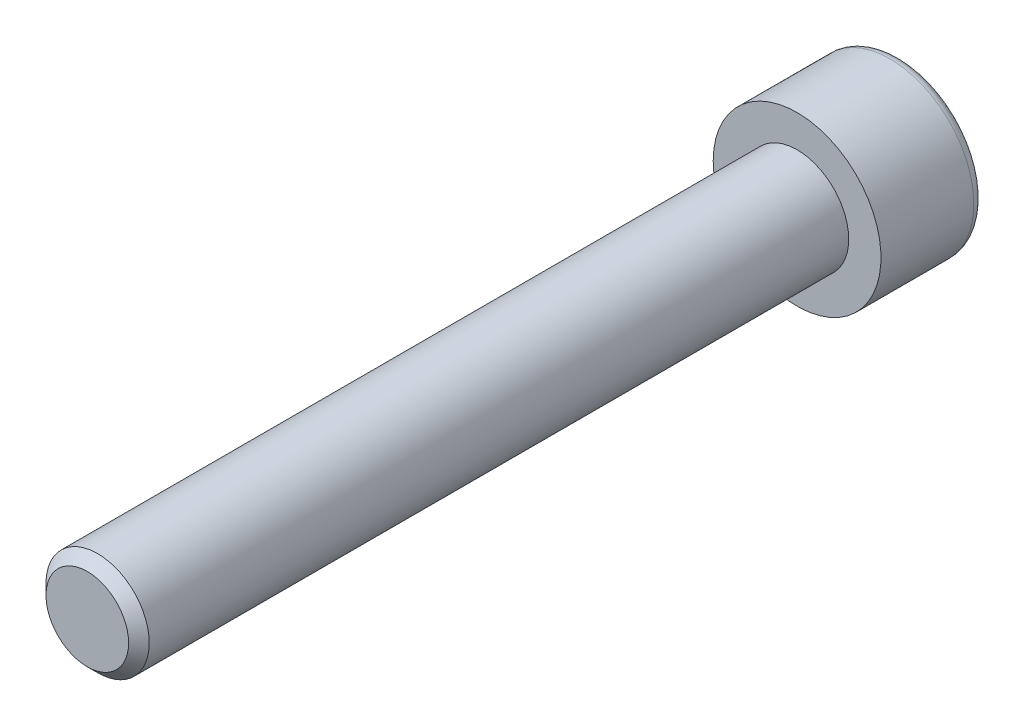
ISO-10303-21;
HEADER;
FILE_DESCRIPTION(('STEP AP214'),'2;1');
FILE_NAME('part.step','',(''),(''),'','','');
FILE_SCHEMA(('AUTOMOTIVE_DESIGN { 1 0 10303 214 1 1 1 1 }'));
ENDSEC;
DATA;
#1=APPLICATION_CONTEXT('core data for automotive mechanical design processes');
#2=APPLICATION_PROTOCOL_DEFINITION('international standard','automotive_design',2000,#1);
#3=PRODUCT_CONTEXT('',#1,'mechanical');
#4=PRODUCT('Part','Part','',(#3));
#5=PRODUCT_RELATED_PRODUCT_CATEGORY('part','',(#4));
#6=PRODUCT_DEFINITION_FORMATION('','',#4);
#7=PRODUCT_DEFINITION_CONTEXT('part definition',#1,'design');
#8=PRODUCT_DEFINITION('design','',#6,#7);
#9=PRODUCT_DEFINITION_SHAPE('','',#8);
#10=(LENGTH_UNIT() NAMED_UNIT(*) SI_UNIT(.MILLI.,.METRE.));
#11=(NAMED_UNIT(*) PLANE_ANGLE_UNIT() SI_UNIT($,.RADIAN.));
#12=(NAMED_UNIT(*) SI_UNIT($,.STERADIAN.) SOLID_ANGLE_UNIT());
#13=UNCERTAINTY_MEASURE_WITH_UNIT(LENGTH_MEASURE(1.E-05),#10,'distance_accuracy_value','');
#14=(GEOMETRIC_REPRESENTATION_CONTEXT(3) GLOBAL_UNCERTAINTY_ASSIGNED_CONTEXT((#13)) GLOBAL_UNIT_ASSIGNED_CONTEXT((#10,
#11,#12)) REPRESENTATION_CONTEXT('',''));
#15=CARTESIAN_POINT('',(0.,0.,0.));
#16=DIRECTION('',(0.,0.,1.));
#17=DIRECTION('',(1.,0.,0.));
#18=AXIS2_PLACEMENT_3D('',#15,#16,#17);
#19=CARTESIAN_POINT('',(0.,0.,-8.00000000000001));
#20=DIRECTION('',(0.,0.,1.));
#21=DIRECTION('',(1.,0.,0.));
#22=AXIS2_PLACEMENT_3D('',#19,#20,#21);
#23=PLANE('',#22);
#24=CARTESIAN_POINT('',(0.,0.,-8.00000000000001));
#25=DIRECTION('',(0.,0.,-1.));
#26=DIRECTION('',(-1.,0.,0.));
#27=AXIS2_PLACEMENT_3D('',#24,#25,#26);
#28=CIRCLE('',#27,5.7);
#29=CARTESIAN_POINT('',(-5.7,0.,-8.00000000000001));
#30=VERTEX_POINT('',#29);
#31=EDGE_CURVE('E141',#30,#30,#28,.T.);
#32=ORIENTED_EDGE('',*,*,#31,.T.);
#33=EDGE_LOOP('',(#32));
#34=FACE_BOUND('',#33,.T.);
#35=DIRECTION('',(-0.86602540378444,0.499999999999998,0.));
#36=VECTOR('',#35,1.);
#37=CARTESIAN_POINT('',(0.,3.46410161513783,-8.00000000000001));
#38=LINE('',#37,#36);
#39=CARTESIAN_POINT('',(3.00000000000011,1.73205080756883,-8.00000000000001));
#40=VERTEX_POINT('',#39);
#41=CARTESIAN_POINT('',(0.,3.46410161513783,-8.00000000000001));
#42=VERTEX_POINT('',#41);
#43=EDGE_CURVE('E45',#40,#42,#38,.T.);
#44=ORIENTED_EDGE('',*,*,#43,.T.);
#45=DIRECTION('',(-0.866025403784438,-0.500000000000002,0.));
#46=VECTOR('',#45,1.);
#47=CARTESIAN_POINT('',(0.,3.46410161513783,-8.00000000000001));
#48=LINE('',#47,#46);
#49=CARTESIAN_POINT('',(-3.,1.73205080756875,-8.00000000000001));
#50=VERTEX_POINT('',#49);
#51=EDGE_CURVE('E85',#42,#50,#48,.T.);
#52=ORIENTED_EDGE('',*,*,#51,.T.);
#53=DIRECTION('',(0.,-1.,0.));
#54=VECTOR('',#53,1.);
#55=CARTESIAN_POINT('',(-2.99999999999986,-1.73205080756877,-8.00000000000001));
#56=LINE('',#55,#54);
#57=CARTESIAN_POINT('',(-2.99999999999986,-1.73205080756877,-8.00000000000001));
#58=VERTEX_POINT('',#57);
#59=EDGE_CURVE('E93',#50,#58,#56,.T.);
#60=ORIENTED_EDGE('',*,*,#59,.T.);
#61=DIRECTION('',(0.866025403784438,-0.500000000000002,0.));
#62=VECTOR('',#61,1.);
#63=CARTESIAN_POINT('',(1.38777878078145E-13,-3.46410161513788,-8.00000000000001));
#64=LINE('',#63,#62);
#65=CARTESIAN_POINT('',(1.38777878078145E-13,-3.46410161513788,-8.00000000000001));
#66=VERTEX_POINT('',#65);
#67=EDGE_CURVE('E111',#58,#66,#64,.T.);
#68=ORIENTED_EDGE('',*,*,#67,.T.);
#69=DIRECTION('',(0.86602540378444,0.499999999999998,0.));
#70=VECTOR('',#69,1.);
#71=CARTESIAN_POINT('',(1.38777878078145E-13,-3.46410161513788,-8.00000000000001));
#72=LINE('',#71,#70);
#73=CARTESIAN_POINT('',(3.00000000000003,-1.73205080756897,-8.00000000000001));
#74=VERTEX_POINT('',#73);
#75=EDGE_CURVE('E114',#66,#74,#72,.T.);
#76=ORIENTED_EDGE('',*,*,#75,.T.);
#77=DIRECTION('',(0.,1.,0.));
#78=VECTOR('',#77,1.);
#79=CARTESIAN_POINT('',(3.00000000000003,-1.73205080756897,-8.00000000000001));
#80=LINE('',#79,#78);
#81=EDGE_CURVE('E104',#74,#40,#80,.T.);
#82=ORIENTED_EDGE('',*,*,#81,.T.);
#83=EDGE_LOOP('',(#44,#52,#60,#68,#76,#82));
#84=FACE_BOUND('',#83,.T.);
#85=ADVANCED_FACE('F31',(#34,#84),#23,.F.);
#86=CARTESIAN_POINT('',(0.,0.,-7.20000000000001));
#87=DIRECTION('',(0.,0.,-1.));
#88=DIRECTION('',(-1.,0.,0.));
#89=AXIS2_PLACEMENT_3D('',#86,#87,#88);
#90=TOROIDAL_SURFACE('',#89,5.7,0.8);
#91=ORIENTED_EDGE('',*,*,#31,.F.);
#92=EDGE_LOOP('',(#91));
#93=FACE_BOUND('',#92,.T.);
#94=CARTESIAN_POINT('',(0.,0.,-7.20000000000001));
#95=DIRECTION('',(0.,0.,-1.));
#96=DIRECTION('',(-1.,0.,0.));
#97=AXIS2_PLACEMENT_3D('',#94,#95,#96);
#98=CIRCLE('',#97,6.5);
#99=CARTESIAN_POINT('',(-6.5,0.,-7.20000000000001));
#100=VERTEX_POINT('',#99);
#101=EDGE_CURVE('E138',#100,#100,#98,.T.);
#102=ORIENTED_EDGE('',*,*,#101,.T.);
#103=EDGE_LOOP('',(#102));
#104=FACE_BOUND('',#103,.T.);
#105=ADVANCED_FACE('F160',(#93,#104),#90,.T.);
#106=CARTESIAN_POINT('',(0.,0.,0.));
#107=DIRECTION('',(0.,0.,-1.));
#108=DIRECTION('',(-1.,0.,0.));
#109=AXIS2_PLACEMENT_3D('',#106,#107,#108);
#110=CYLINDRICAL_SURFACE('',#109,6.5);
#111=ORIENTED_EDGE('',*,*,#101,.F.);
#112=EDGE_LOOP('',(#111));
#113=FACE_BOUND('',#112,.T.);
#114=CARTESIAN_POINT('',(0.,0.,0.));
#115=DIRECTION('',(0.,0.,-1.));
#116=DIRECTION('',(-1.,0.,0.));
#117=AXIS2_PLACEMENT_3D('',#114,#115,#116);
#118=CIRCLE('',#117,6.5);
#119=CARTESIAN_POINT('',(-6.5,0.,0.));
#120=VERTEX_POINT('',#119);
#121=EDGE_CURVE('E99',#120,#120,#118,.T.);
#122=ORIENTED_EDGE('',*,*,#121,.T.);
#123=EDGE_LOOP('',(#122));
#124=FACE_BOUND('',#123,.T.);
#125=ADVANCED_FACE('F165',(#113,#124),#110,.T.);
#126=CARTESIAN_POINT('',(0.,0.,0.));
#127=DIRECTION('',(0.,0.,-1.));
#128=DIRECTION('',(-1.,0.,0.));
#129=AXIS2_PLACEMENT_3D('',#126,#127,#128);
#130=PLANE('',#129);
#131=CARTESIAN_POINT('',(0.,0.,0.));
#132=DIRECTION('',(0.,0.,1.));
#133=DIRECTION('',(1.,0.,0.));
#134=AXIS2_PLACEMENT_3D('',#131,#132,#133);
#135=CIRCLE('',#134,4.);
#136=CARTESIAN_POINT('',(4.,0.,0.));
#137=VERTEX_POINT('',#136);
#138=EDGE_CURVE('E105',#137,#137,#135,.T.);
#139=ORIENTED_EDGE('',*,*,#138,.F.);
#140=EDGE_LOOP('',(#139));
#141=FACE_BOUND('',#140,.T.);
#142=ORIENTED_EDGE('',*,*,#121,.F.);
#143=EDGE_LOOP('',(#142));
#144=FACE_BOUND('',#143,.T.);
#145=ADVANCED_FACE('F173',(#141,#144),#130,.F.);
#146=CARTESIAN_POINT('',(0.,3.46410161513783,-4.));
#147=DIRECTION('',(-0.499999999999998,-0.86602540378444,0.));
#148=DIRECTION('',(0.86602540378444,-0.499999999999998,0.));
#149=AXIS2_PLACEMENT_3D('',#146,#147,#148);
#150=PLANE('',#149);
#151=ORIENTED_EDGE('',*,*,#43,.F.);
#152=DIRECTION('',(0.,0.,-1.));
#153=VECTOR('',#152,1.);
#154=CARTESIAN_POINT('',(3.00000000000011,1.73205080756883,-4.));
#155=LINE('',#154,#153);
#156=CARTESIAN_POINT('',(3.00000000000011,1.73205080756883,-4.));
#157=VERTEX_POINT('',#156);
#158=EDGE_CURVE('E127',#157,#40,#155,.T.);
#159=ORIENTED_EDGE('',*,*,#158,.F.);
#160=DIRECTION('',(-0.86602540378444,0.499999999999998,0.));
#161=VECTOR('',#160,1.);
#162=CARTESIAN_POINT('',(0.,3.46410161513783,-4.));
#163=LINE('',#162,#161);
#164=CARTESIAN_POINT('',(0.,3.46410161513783,-4.));
#165=VERTEX_POINT('',#164);
#166=EDGE_CURVE('E98',#157,#165,#163,.T.);
#167=ORIENTED_EDGE('',*,*,#166,.T.);
#168=DIRECTION('',(0.,0.,-1.));
#169=VECTOR('',#168,1.);
#170=CARTESIAN_POINT('',(0.,3.46410161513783,-4.));
#171=LINE('',#170,#169);
#172=EDGE_CURVE('E87',#165,#42,#171,.T.);
#173=ORIENTED_EDGE('',*,*,#172,.T.);
#174=EDGE_LOOP('',(#151,#159,#167,#173));
#175=FACE_BOUND('',#174,.T.);
#176=ADVANCED_FACE('F96',(#175),#150,.T.);
#177=CARTESIAN_POINT('',(0.,3.46410161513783,-4.));
#178=DIRECTION('',(0.500000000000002,-0.866025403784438,0.));
#179=DIRECTION('',(0.866025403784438,0.500000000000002,0.));
#180=AXIS2_PLACEMENT_3D('',#177,#178,#179);
#181=PLANE('',#180);
#182=ORIENTED_EDGE('',*,*,#51,.F.);
#183=ORIENTED_EDGE('',*,*,#172,.F.);
#184=DIRECTION('',(-0.866025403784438,-0.500000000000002,0.));
#185=VECTOR('',#184,1.);
#186=CARTESIAN_POINT('',(0.,3.46410161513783,-4.));
#187=LINE('',#186,#185);
#188=CARTESIAN_POINT('',(-3.,1.73205080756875,-4.));
#189=VERTEX_POINT('',#188);
#190=EDGE_CURVE('E118',#165,#189,#187,.T.);
#191=ORIENTED_EDGE('',*,*,#190,.T.);
#192=DIRECTION('',(0.,0.,-1.));
#193=VECTOR('',#192,1.);
#194=CARTESIAN_POINT('',(-3.,1.73205080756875,-4.));
#195=LINE('',#194,#193);
#196=EDGE_CURVE('E89',#189,#50,#195,.T.);
#197=ORIENTED_EDGE('',*,*,#196,.T.);
#198=EDGE_LOOP('',(#182,#183,#191,#197));
#199=FACE_BOUND('',#198,.T.);
#200=ADVANCED_FACE('F86',(#199),#181,.T.);
#201=CARTESIAN_POINT('',(-2.99999999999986,-1.73205080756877,-4.));
#202=DIRECTION('',(1.,0.,0.));
#203=DIRECTION('',(0.,0.,-1.));
#204=AXIS2_PLACEMENT_3D('',#201,#202,#203);
#205=PLANE('',#204);
#206=ORIENTED_EDGE('',*,*,#59,.F.);
#207=ORIENTED_EDGE('',*,*,#196,.F.);
#208=DIRECTION('',(0.,-1.,0.));
#209=VECTOR('',#208,1.);
#210=CARTESIAN_POINT('',(-2.99999999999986,-1.73205080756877,-4.));
#211=LINE('',#210,#209);
#212=CARTESIAN_POINT('',(-2.99999999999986,-1.73205080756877,-4.));
#213=VERTEX_POINT('',#212);
#214=EDGE_CURVE('E120',#189,#213,#211,.T.);
#215=ORIENTED_EDGE('',*,*,#214,.T.);
#216=DIRECTION('',(0.,0.,-1.));
#217=VECTOR('',#216,1.);
#218=CARTESIAN_POINT('',(-2.99999999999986,-1.73205080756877,-4.));
#219=LINE('',#218,#217);
#220=EDGE_CURVE('E133',#213,#58,#219,.T.);
#221=ORIENTED_EDGE('',*,*,#220,.T.);
#222=EDGE_LOOP('',(#206,#207,#215,#221));
#223=FACE_BOUND('',#222,.T.);
#224=ADVANCED_FACE('F188',(#223),#205,.T.);
#225=CARTESIAN_POINT('',(1.38777878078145E-13,-3.46410161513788,-4.));
#226=DIRECTION('',(0.500000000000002,0.866025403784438,0.));
#227=DIRECTION('',(-0.866025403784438,0.500000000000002,0.));
#228=AXIS2_PLACEMENT_3D('',#225,#226,#227);
#229=PLANE('',#228);
#230=ORIENTED_EDGE('',*,*,#67,.F.);
#231=ORIENTED_EDGE('',*,*,#220,.F.);
#232=DIRECTION('',(0.866025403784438,-0.500000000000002,0.));
#233=VECTOR('',#232,1.);
#234=CARTESIAN_POINT('',(1.38777878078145E-13,-3.46410161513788,-4.));
#235=LINE('',#234,#233);
#236=CARTESIAN_POINT('',(1.38777878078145E-13,-3.46410161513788,-4.));
#237=VERTEX_POINT('',#236);
#238=EDGE_CURVE('E122',#213,#237,#235,.T.);
#239=ORIENTED_EDGE('',*,*,#238,.T.);
#240=DIRECTION('',(0.,0.,-1.));
#241=VECTOR('',#240,1.);
#242=CARTESIAN_POINT('',(1.38777878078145E-13,-3.46410161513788,-4.));
#243=LINE('',#242,#241);
#244=EDGE_CURVE('E131',#237,#66,#243,.T.);
#245=ORIENTED_EDGE('',*,*,#244,.T.);
#246=EDGE_LOOP('',(#230,#231,#239,#245));
#247=FACE_BOUND('',#246,.T.);
#248=ADVANCED_FACE('F191',(#247),#229,.T.);
#249=CARTESIAN_POINT('',(1.38777878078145E-13,-3.46410161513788,-4.));
#250=DIRECTION('',(-0.499999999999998,0.86602540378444,0.));
#251=DIRECTION('',(-0.86602540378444,-0.499999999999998,0.));
#252=AXIS2_PLACEMENT_3D('',#249,#250,#251);
#253=PLANE('',#252);
#254=ORIENTED_EDGE('',*,*,#75,.F.);
#255=ORIENTED_EDGE('',*,*,#244,.F.);
#256=DIRECTION('',(0.86602540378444,0.499999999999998,0.));
#257=VECTOR('',#256,1.);
#258=CARTESIAN_POINT('',(1.38777878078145E-13,-3.46410161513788,-4.));
#259=LINE('',#258,#257);
#260=CARTESIAN_POINT('',(3.00000000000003,-1.73205080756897,-4.));
#261=VERTEX_POINT('',#260);
#262=EDGE_CURVE('E124',#237,#261,#259,.T.);
#263=ORIENTED_EDGE('',*,*,#262,.T.);
#264=DIRECTION('',(0.,0.,-1.));
#265=VECTOR('',#264,1.);
#266=CARTESIAN_POINT('',(3.00000000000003,-1.73205080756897,-4.));
#267=LINE('',#266,#265);
#268=EDGE_CURVE('E129',#261,#74,#267,.T.);
#269=ORIENTED_EDGE('',*,*,#268,.T.);
#270=EDGE_LOOP('',(#254,#255,#263,#269));
#271=FACE_BOUND('',#270,.T.);
#272=ADVANCED_FACE('F195',(#271),#253,.T.);
#273=CARTESIAN_POINT('',(3.00000000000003,-1.73205080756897,-4.));
#274=DIRECTION('',(-1.,0.,0.));
#275=DIRECTION('',(0.,0.,1.));
#276=AXIS2_PLACEMENT_3D('',#273,#274,#275);
#277=PLANE('',#276);
#278=ORIENTED_EDGE('',*,*,#81,.F.);
#279=ORIENTED_EDGE('',*,*,#268,.F.);
#280=DIRECTION('',(0.,1.,0.));
#281=VECTOR('',#280,1.);
#282=CARTESIAN_POINT('',(3.00000000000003,-1.73205080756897,-4.));
#283=LINE('',#282,#281);
#284=EDGE_CURVE('E52',#261,#157,#283,.T.);
#285=ORIENTED_EDGE('',*,*,#284,.T.);
#286=ORIENTED_EDGE('',*,*,#158,.T.);
#287=EDGE_LOOP('',(#278,#279,#285,#286));
#288=FACE_BOUND('',#287,.T.);
#289=ADVANCED_FACE('F199',(#288),#277,.T.);
#290=CARTESIAN_POINT('',(3.00000000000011,1.73205080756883,-4.));
#291=DIRECTION('',(0.,0.,1.));
#292=DIRECTION('',(1.,0.,0.));
#293=AXIS2_PLACEMENT_3D('',#290,#291,#292);
#294=PLANE('',#293);
#295=ORIENTED_EDGE('',*,*,#166,.F.);
#296=ORIENTED_EDGE('',*,*,#284,.F.);
#297=ORIENTED_EDGE('',*,*,#262,.F.);
#298=ORIENTED_EDGE('',*,*,#238,.F.);
#299=ORIENTED_EDGE('',*,*,#214,.F.);
#300=ORIENTED_EDGE('',*,*,#190,.F.);
#301=EDGE_LOOP('',(#295,#296,#297,#298,#299,#300));
#302=FACE_BOUND('',#301,.T.);
#303=ADVANCED_FACE('F203',(#302),#294,.F.);
#304=CARTESIAN_POINT('',(0.,0.,55.));
#305=DIRECTION('',(0.,0.,1.));
#306=DIRECTION('',(1.,0.,0.));
#307=AXIS2_PLACEMENT_3D('',#304,#305,#306);
#308=PLANE('',#307);
#309=CARTESIAN_POINT('',(0.,0.,55.));
#310=DIRECTION('',(0.,0.,1.));
#311=DIRECTION('',(1.,0.,0.));
#312=AXIS2_PLACEMENT_3D('',#309,#310,#311);
#313=CIRCLE('',#312,3.2);
#314=CARTESIAN_POINT('',(3.2,0.,55.));
#315=VERTEX_POINT('',#314);
#316=EDGE_CURVE('E38',#315,#315,#313,.T.);
#317=ORIENTED_EDGE('',*,*,#316,.T.);
#318=EDGE_LOOP('',(#317));
#319=FACE_BOUND('',#318,.T.);
#320=ADVANCED_FACE('F146',(#319),#308,.T.);
#321=CARTESIAN_POINT('',(0.,0.,0.));
#322=DIRECTION('',(0.,0.,1.));
#323=DIRECTION('',(1.,0.,0.));
#324=AXIS2_PLACEMENT_3D('',#321,#322,#323);
#325=CYLINDRICAL_SURFACE('',#324,4.);
#326=CARTESIAN_POINT('',(0.,0.,54.2));
#327=DIRECTION('',(0.,0.,1.));
#328=DIRECTION('',(1.,0.,0.));
#329=AXIS2_PLACEMENT_3D('',#326,#327,#328);
#330=CIRCLE('',#329,4.);
#331=CARTESIAN_POINT('',(4.,0.,54.2));
#332=VERTEX_POINT('',#331);
#333=EDGE_CURVE('E11',#332,#332,#330,.F.);
#334=ORIENTED_EDGE('',*,*,#333,.T.);
#335=EDGE_LOOP('',(#334));
#336=FACE_BOUND('',#335,.T.);
#337=ORIENTED_EDGE('',*,*,#138,.T.);
#338=EDGE_LOOP('',(#337));
#339=FACE_BOUND('',#338,.T.);
#340=ADVANCED_FACE('F150',(#336,#339),#325,.T.);
#341=CARTESIAN_POINT('',(0.,0.,55.));
#342=DIRECTION('',(0.,0.,-1.));
#343=DIRECTION('',(-1.,0.,0.));
#344=AXIS2_PLACEMENT_3D('',#341,#342,#343);
#345=CONICAL_SURFACE('',#344,3.2,0.78539816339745);
#346=ORIENTED_EDGE('',*,*,#333,.F.);
#347=EDGE_LOOP('',(#346));
#348=FACE_BOUND('',#347,.T.);
#349=ORIENTED_EDGE('',*,*,#316,.F.);
#350=EDGE_LOOP('',(#349));
#351=FACE_BOUND('',#350,.T.);
#352=ADVANCED_FACE('F148',(#348,#351),#345,.T.);
#353=CLOSED_SHELL('',(#85,#105,#125,#145,#176,#200,#224,#248,#272,#289,#303,#320,#340,#352));
#354=MANIFOLD_SOLID_BREP('B2',#353);
#355=ADVANCED_BREP_SHAPE_REPRESENTATION('',(#18,#354),#14);
#356=SHAPE_DEFINITION_REPRESENTATION(#9,#355);
ENDSEC;
END-ISO-10303-21;
